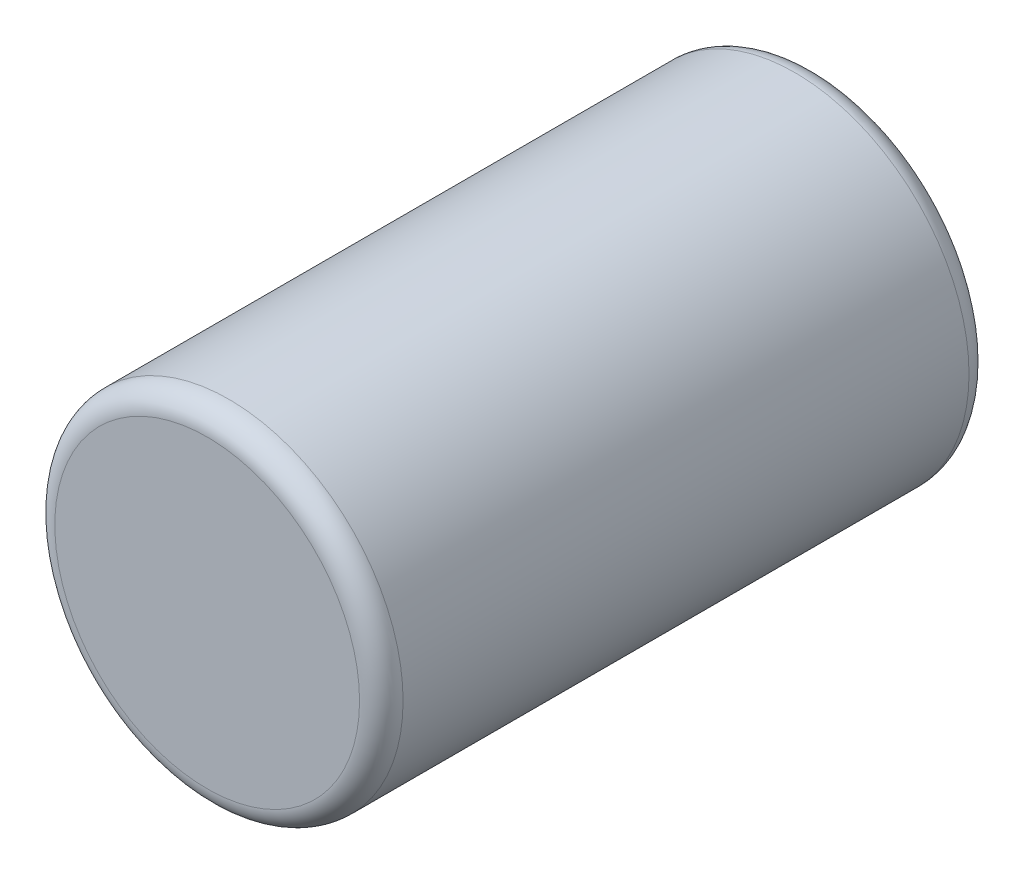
ISO-10303-21;
HEADER;
FILE_DESCRIPTION(('STEP AP214'),'2;1');
FILE_NAME('part.step','',(''),(''),'','','');
FILE_SCHEMA(('AUTOMOTIVE_DESIGN { 1 0 10303 214 1 1 1 1 }'));
ENDSEC;
DATA;
#1=APPLICATION_CONTEXT('core data for automotive mechanical design processes');
#2=APPLICATION_PROTOCOL_DEFINITION('international standard','automotive_design',2000,#1);
#3=PRODUCT_CONTEXT('',#1,'mechanical');
#4=PRODUCT('Part','Part','',(#3));
#5=PRODUCT_RELATED_PRODUCT_CATEGORY('part','',(#4));
#6=PRODUCT_DEFINITION_FORMATION('','',#4);
#7=PRODUCT_DEFINITION_CONTEXT('part definition',#1,'design');
#8=PRODUCT_DEFINITION('design','',#6,#7);
#9=PRODUCT_DEFINITION_SHAPE('','',#8);
#10=(LENGTH_UNIT() NAMED_UNIT(*) SI_UNIT(.MILLI.,.METRE.));
#11=(NAMED_UNIT(*) PLANE_ANGLE_UNIT() SI_UNIT($,.RADIAN.));
#12=(NAMED_UNIT(*) SI_UNIT($,.STERADIAN.) SOLID_ANGLE_UNIT());
#13=UNCERTAINTY_MEASURE_WITH_UNIT(LENGTH_MEASURE(1.E-05),#10,'distance_accuracy_value','');
#14=(GEOMETRIC_REPRESENTATION_CONTEXT(3) GLOBAL_UNCERTAINTY_ASSIGNED_CONTEXT((#13)) GLOBAL_UNIT_ASSIGNED_CONTEXT((#10,
#11,#12)) REPRESENTATION_CONTEXT('',''));
#15=CARTESIAN_POINT('',(0.,0.,0.));
#16=DIRECTION('',(0.,0.,1.));
#17=DIRECTION('',(1.,0.,0.));
#18=AXIS2_PLACEMENT_3D('',#15,#16,#17);
#19=CARTESIAN_POINT('',(0.,0.,140.));
#20=DIRECTION('',(0.,0.,-1.));
#21=DIRECTION('',(-1.,0.,0.));
#22=AXIS2_PLACEMENT_3D('',#19,#20,#21);
#23=CYLINDRICAL_SURFACE('',#22,40.);
#24=CARTESIAN_POINT('',(0.,0.,5.));
#25=DIRECTION('',(0.,0.,1.));
#26=DIRECTION('',(1.,0.,0.));
#27=AXIS2_PLACEMENT_3D('',#24,#25,#26);
#28=CIRCLE('',#27,40.);
#29=CARTESIAN_POINT('',(40.,0.,5.));
#30=VERTEX_POINT('',#29);
#31=EDGE_CURVE('E40',#30,#30,#28,.T.);
#32=ORIENTED_EDGE('',*,*,#31,.T.);
#33=EDGE_LOOP('',(#32));
#34=FACE_BOUND('',#33,.T.);
#35=CARTESIAN_POINT('',(0.,0.,135.));
#36=DIRECTION('',(0.,0.,1.));
#37=DIRECTION('',(1.,0.,0.));
#38=AXIS2_PLACEMENT_3D('',#35,#36,#37);
#39=CIRCLE('',#38,40.);
#40=CARTESIAN_POINT('',(40.,0.,135.));
#41=VERTEX_POINT('',#40);
#42=EDGE_CURVE('E44',#41,#41,#39,.F.);
#43=ORIENTED_EDGE('',*,*,#42,.T.);
#44=EDGE_LOOP('',(#43));
#45=FACE_BOUND('',#44,.T.);
#46=ADVANCED_FACE('F30',(#34,#45),#23,.T.);
#47=CARTESIAN_POINT('',(0.,0.,140.));
#48=DIRECTION('',(0.,0.,1.));
#49=DIRECTION('',(1.,0.,0.));
#50=AXIS2_PLACEMENT_3D('',#47,#48,#49);
#51=PLANE('',#50);
#52=CARTESIAN_POINT('',(0.,0.,140.));
#53=DIRECTION('',(0.,0.,1.));
#54=DIRECTION('',(1.,0.,0.));
#55=AXIS2_PLACEMENT_3D('',#52,#53,#54);
#56=CIRCLE('',#55,35.);
#57=CARTESIAN_POINT('',(35.,0.,140.));
#58=VERTEX_POINT('',#57);
#59=EDGE_CURVE('E10',#58,#58,#56,.T.);
#60=ORIENTED_EDGE('',*,*,#59,.T.);
#61=EDGE_LOOP('',(#60));
#62=FACE_BOUND('',#61,.T.);
#63=ADVANCED_FACE('F63',(#62),#51,.T.);
#64=CARTESIAN_POINT('',(0.,0.,0.));
#65=DIRECTION('',(0.,0.,1.));
#66=DIRECTION('',(1.,0.,0.));
#67=AXIS2_PLACEMENT_3D('',#64,#65,#66);
#68=PLANE('',#67);
#69=CARTESIAN_POINT('',(0.,0.,0.));
#70=DIRECTION('',(0.,0.,1.));
#71=DIRECTION('',(1.,0.,0.));
#72=AXIS2_PLACEMENT_3D('',#69,#70,#71);
#73=CIRCLE('',#72,35.);
#74=CARTESIAN_POINT('',(35.,0.,0.));
#75=VERTEX_POINT('',#74);
#76=EDGE_CURVE('E36',#75,#75,#73,.F.);
#77=ORIENTED_EDGE('',*,*,#76,.T.);
#78=EDGE_LOOP('',(#77));
#79=FACE_BOUND('',#78,.T.);
#80=ADVANCED_FACE('F59',(#79),#68,.F.);
#81=CARTESIAN_POINT('',(0.,0.,5.));
#82=DIRECTION('',(0.,0.,1.));
#83=DIRECTION('',(1.,0.,0.));
#84=AXIS2_PLACEMENT_3D('',#81,#82,#83);
#85=TOROIDAL_SURFACE('',#84,35.,5.);
#86=ORIENTED_EDGE('',*,*,#76,.F.);
#87=EDGE_LOOP('',(#86));
#88=FACE_BOUND('',#87,.T.);
#89=ORIENTED_EDGE('',*,*,#31,.F.);
#90=EDGE_LOOP('',(#89));
#91=FACE_BOUND('',#90,.T.);
#92=ADVANCED_FACE('F54',(#88,#91),#85,.T.);
#93=CARTESIAN_POINT('',(0.,0.,135.));
#94=DIRECTION('',(0.,0.,1.));
#95=DIRECTION('',(1.,0.,0.));
#96=AXIS2_PLACEMENT_3D('',#93,#94,#95);
#97=TOROIDAL_SURFACE('',#96,35.,5.);
#98=ORIENTED_EDGE('',*,*,#42,.F.);
#99=EDGE_LOOP('',(#98));
#100=FACE_BOUND('',#99,.T.);
#101=ORIENTED_EDGE('',*,*,#59,.F.);
#102=EDGE_LOOP('',(#101));
#103=FACE_BOUND('',#102,.T.);
#104=ADVANCED_FACE('F51',(#100,#103),#97,.T.);
#105=CLOSED_SHELL('',(#46,#63,#80,#92,#104));
#106=MANIFOLD_SOLID_BREP('B2',#105);
#107=ADVANCED_BREP_SHAPE_REPRESENTATION('',(#18,#106),#14);
#108=SHAPE_DEFINITION_REPRESENTATION(#9,#107);
ENDSEC;
END-ISO-10303-21;
